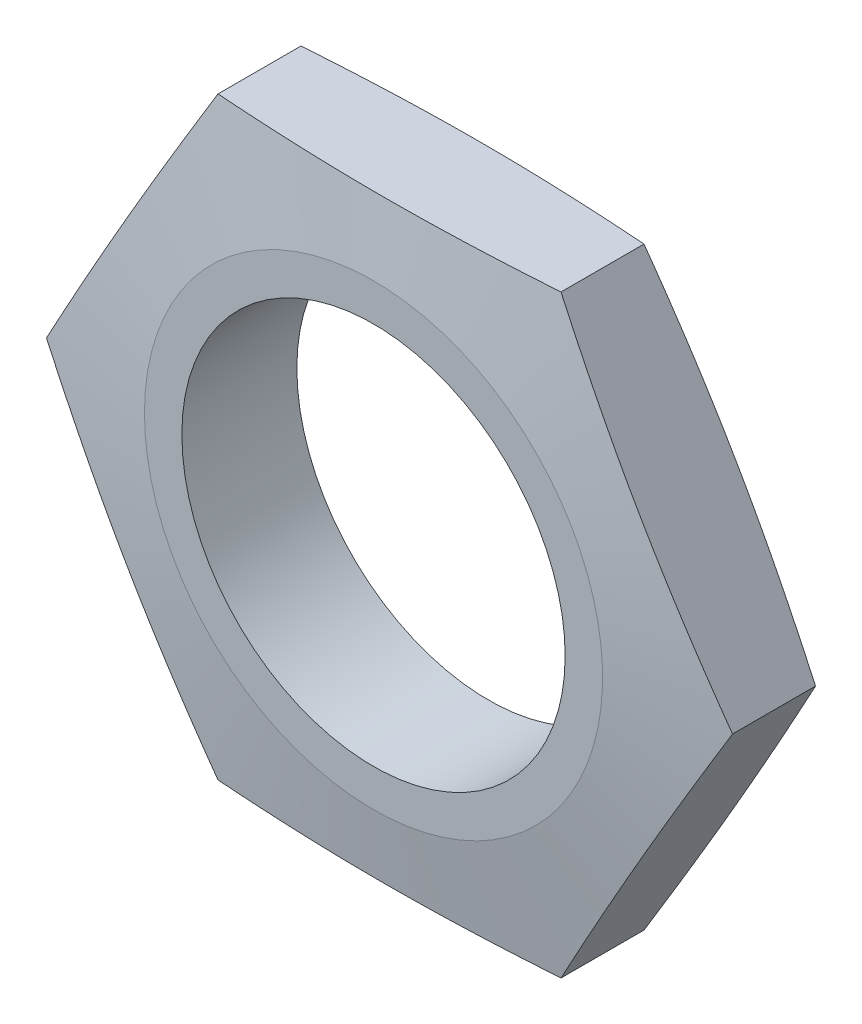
from build123d import *

# Parameters (mm, degrees)
SKETCH2_R          = 7.62
BASE_EXTRUDE_DEPTH = 2.286


with BuildPart() as part:
    # Sketch2 → Base-Extrude (new, symmetric)
    with BuildSketch(Plane.XY):
        Polygon((6.819084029, -11.811), (13.638168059, 0), (6.819084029, 11.811), (-6.819084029, 11.811), (-13.638168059, 0), (-6.819084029, -11.811), align=None)
        Circle(SKETCH2_R, mode=Mode.SUBTRACT)
    extrude(amount=BASE_EXTRUDE_DEPTH, both=True)

    # Sketch4 → Cut-Revolve1 (revolve, cut)
    with BuildSketch(Plane(origin=(0, 0, 0), x_dir=(1, 0, 0), z_dir=(0, 1, 0)), mode=Mode.PRIVATE) as cut_revolve1_sk:
        Polygon((9.10736438, 2.286), (13.638168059, 1.64964364), (13.638168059, 2.286), align=None)
        Polygon((9.10736438, -2.286), (13.638168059, -1.64964364), (13.638168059, -2.286), align=None)
    revolve(cut_revolve1_sk.sketch.rotate(Axis((0, 0, -3.557999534), (0, 0, 1)), 180), axis=Axis((0, 0, -3.557999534), (0, 0, 1)), mode=Mode.SUBTRACT)


solid = part.part
